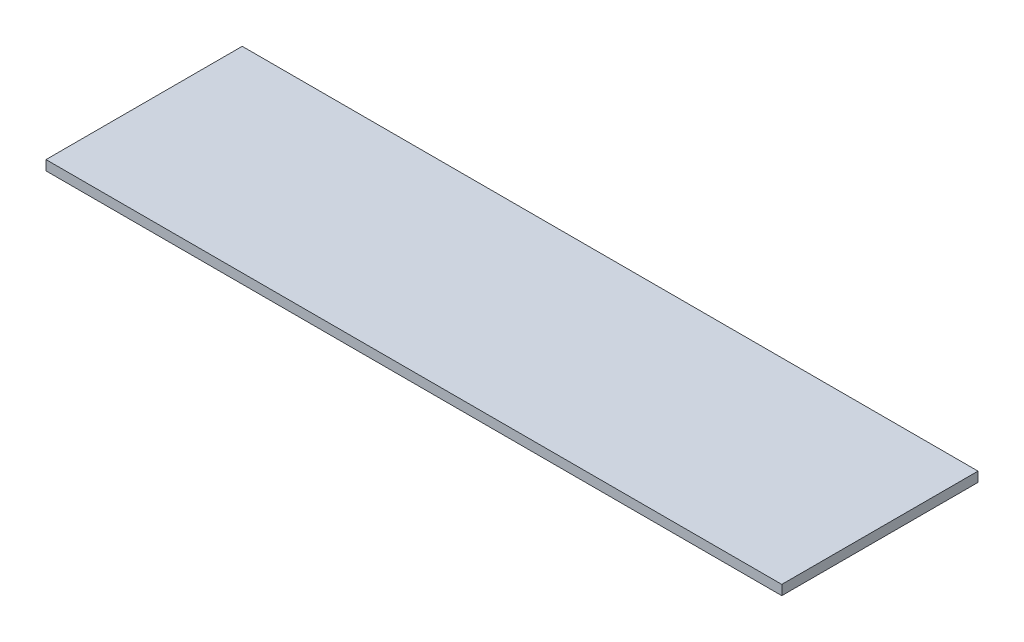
ISO-10303-21;
HEADER;
FILE_DESCRIPTION(('STEP AP214'),'2;1');
FILE_NAME('part.step','',(''),(''),'','','');
FILE_SCHEMA(('AUTOMOTIVE_DESIGN { 1 0 10303 214 1 1 1 1 }'));
ENDSEC;
DATA;
#1=APPLICATION_CONTEXT('core data for automotive mechanical design processes');
#2=APPLICATION_PROTOCOL_DEFINITION('international standard','automotive_design',2000,#1);
#3=PRODUCT_CONTEXT('',#1,'mechanical');
#4=PRODUCT('Part','Part','',(#3));
#5=PRODUCT_RELATED_PRODUCT_CATEGORY('part','',(#4));
#6=PRODUCT_DEFINITION_FORMATION('','',#4);
#7=PRODUCT_DEFINITION_CONTEXT('part definition',#1,'design');
#8=PRODUCT_DEFINITION('design','',#6,#7);
#9=PRODUCT_DEFINITION_SHAPE('','',#8);
#10=(LENGTH_UNIT() NAMED_UNIT(*) SI_UNIT(.MILLI.,.METRE.));
#11=(NAMED_UNIT(*) PLANE_ANGLE_UNIT() SI_UNIT($,.RADIAN.));
#12=(NAMED_UNIT(*) SI_UNIT($,.STERADIAN.) SOLID_ANGLE_UNIT());
#13=UNCERTAINTY_MEASURE_WITH_UNIT(LENGTH_MEASURE(1.E-05),#10,'distance_accuracy_value','');
#14=(GEOMETRIC_REPRESENTATION_CONTEXT(3) GLOBAL_UNCERTAINTY_ASSIGNED_CONTEXT((#13)) GLOBAL_UNIT_ASSIGNED_CONTEXT((#10,
#11,#12)) REPRESENTATION_CONTEXT('',''));
#15=CARTESIAN_POINT('',(0.,0.,0.));
#16=DIRECTION('',(0.,0.,1.));
#17=DIRECTION('',(1.,0.,0.));
#18=AXIS2_PLACEMENT_3D('',#15,#16,#17);
#19=CARTESIAN_POINT('',(0.,1.,0.));
#20=DIRECTION('',(1.,0.,0.));
#21=DIRECTION('',(0.,0.,-1.));
#22=AXIS2_PLACEMENT_3D('',#19,#20,#21);
#23=PLANE('',#22);
#24=DIRECTION('',(0.,0.,1.));
#25=VECTOR('',#24,1.);
#26=CARTESIAN_POINT('',(0.,0.,0.));
#27=LINE('',#26,#25);
#28=CARTESIAN_POINT('',(0.,0.,-20.));
#29=VERTEX_POINT('',#28);
#30=CARTESIAN_POINT('',(0.,0.,0.));
#31=VERTEX_POINT('',#30);
#32=EDGE_CURVE('E74',#29,#31,#27,.T.);
#33=ORIENTED_EDGE('',*,*,#32,.T.);
#34=DIRECTION('',(0.,-1.,0.));
#35=VECTOR('',#34,1.);
#36=CARTESIAN_POINT('',(0.,1.,0.));
#37=LINE('',#36,#35);
#38=CARTESIAN_POINT('',(0.,1.,0.));
#39=VERTEX_POINT('',#38);
#40=EDGE_CURVE('E11',#39,#31,#37,.T.);
#41=ORIENTED_EDGE('',*,*,#40,.F.);
#42=DIRECTION('',(0.,0.,1.));
#43=VECTOR('',#42,1.);
#44=CARTESIAN_POINT('',(0.,1.,0.));
#45=LINE('',#44,#43);
#46=CARTESIAN_POINT('',(0.,1.,-20.));
#47=VERTEX_POINT('',#46);
#48=EDGE_CURVE('E92',#47,#39,#45,.T.);
#49=ORIENTED_EDGE('',*,*,#48,.F.);
#50=DIRECTION('',(0.,-1.,0.));
#51=VECTOR('',#50,1.);
#52=CARTESIAN_POINT('',(0.,1.,-20.));
#53=LINE('',#52,#51);
#54=EDGE_CURVE('E86',#47,#29,#53,.T.);
#55=ORIENTED_EDGE('',*,*,#54,.T.);
#56=EDGE_LOOP('',(#33,#41,#49,#55));
#57=FACE_BOUND('',#56,.T.);
#58=ADVANCED_FACE('F30',(#57),#23,.F.);
#59=CARTESIAN_POINT('',(0.,1.,0.));
#60=DIRECTION('',(0.,0.,-1.));
#61=DIRECTION('',(-1.,0.,0.));
#62=AXIS2_PLACEMENT_3D('',#59,#60,#61);
#63=PLANE('',#62);
#64=DIRECTION('',(1.,0.,0.));
#65=VECTOR('',#64,1.);
#66=CARTESIAN_POINT('',(0.,0.,0.));
#67=LINE('',#66,#65);
#68=CARTESIAN_POINT('',(75.,0.,0.));
#69=VERTEX_POINT('',#68);
#70=EDGE_CURVE('E70',#31,#69,#67,.T.);
#71=ORIENTED_EDGE('',*,*,#70,.T.);
#72=DIRECTION('',(0.,-1.,0.));
#73=VECTOR('',#72,1.);
#74=CARTESIAN_POINT('',(75.,1.,0.));
#75=LINE('',#74,#73);
#76=CARTESIAN_POINT('',(75.,1.,0.));
#77=VERTEX_POINT('',#76);
#78=EDGE_CURVE('E37',#77,#69,#75,.T.);
#79=ORIENTED_EDGE('',*,*,#78,.F.);
#80=DIRECTION('',(1.,0.,0.));
#81=VECTOR('',#80,1.);
#82=CARTESIAN_POINT('',(0.,1.,0.));
#83=LINE('',#82,#81);
#84=EDGE_CURVE('E82',#39,#77,#83,.T.);
#85=ORIENTED_EDGE('',*,*,#84,.F.);
#86=ORIENTED_EDGE('',*,*,#40,.T.);
#87=EDGE_LOOP('',(#71,#79,#85,#86));
#88=FACE_BOUND('',#87,.T.);
#89=ADVANCED_FACE('F81',(#88),#63,.F.);
#90=CARTESIAN_POINT('',(75.,1.,0.));
#91=DIRECTION('',(-1.,0.,0.));
#92=DIRECTION('',(0.,0.,1.));
#93=AXIS2_PLACEMENT_3D('',#90,#91,#92);
#94=PLANE('',#93);
#95=DIRECTION('',(0.,0.,-1.));
#96=VECTOR('',#95,1.);
#97=CARTESIAN_POINT('',(75.,0.,0.));
#98=LINE('',#97,#96);
#99=CARTESIAN_POINT('',(75.,0.,-20.));
#100=VERTEX_POINT('',#99);
#101=EDGE_CURVE('E75',#69,#100,#98,.T.);
#102=ORIENTED_EDGE('',*,*,#101,.T.);
#103=DIRECTION('',(0.,-1.,0.));
#104=VECTOR('',#103,1.);
#105=CARTESIAN_POINT('',(75.,1.,-20.));
#106=LINE('',#105,#104);
#107=CARTESIAN_POINT('',(75.,1.,-20.));
#108=VERTEX_POINT('',#107);
#109=EDGE_CURVE('E98',#108,#100,#106,.T.);
#110=ORIENTED_EDGE('',*,*,#109,.F.);
#111=DIRECTION('',(0.,0.,-1.));
#112=VECTOR('',#111,1.);
#113=CARTESIAN_POINT('',(75.,1.,0.));
#114=LINE('',#113,#112);
#115=EDGE_CURVE('E49',#77,#108,#114,.T.);
#116=ORIENTED_EDGE('',*,*,#115,.F.);
#117=ORIENTED_EDGE('',*,*,#78,.T.);
#118=EDGE_LOOP('',(#102,#110,#116,#117));
#119=FACE_BOUND('',#118,.T.);
#120=ADVANCED_FACE('F101',(#119),#94,.F.);
#121=CARTESIAN_POINT('',(0.,1.,-20.));
#122=DIRECTION('',(0.,0.,1.));
#123=DIRECTION('',(1.,0.,0.));
#124=AXIS2_PLACEMENT_3D('',#121,#122,#123);
#125=PLANE('',#124);
#126=DIRECTION('',(-1.,0.,0.));
#127=VECTOR('',#126,1.);
#128=CARTESIAN_POINT('',(0.,0.,-20.));
#129=LINE('',#128,#127);
#130=EDGE_CURVE('E90',#100,#29,#129,.T.);
#131=ORIENTED_EDGE('',*,*,#130,.T.);
#132=ORIENTED_EDGE('',*,*,#54,.F.);
#133=DIRECTION('',(-1.,0.,0.));
#134=VECTOR('',#133,1.);
#135=CARTESIAN_POINT('',(0.,1.,-20.));
#136=LINE('',#135,#134);
#137=EDGE_CURVE('E44',#108,#47,#136,.T.);
#138=ORIENTED_EDGE('',*,*,#137,.F.);
#139=ORIENTED_EDGE('',*,*,#109,.T.);
#140=EDGE_LOOP('',(#131,#132,#138,#139));
#141=FACE_BOUND('',#140,.T.);
#142=ADVANCED_FACE('F103',(#141),#125,.F.);
#143=CARTESIAN_POINT('',(0.,1.,-20.));
#144=DIRECTION('',(0.,-1.,0.));
#145=DIRECTION('',(0.,0.,-1.));
#146=AXIS2_PLACEMENT_3D('',#143,#144,#145);
#147=PLANE('',#146);
#148=ORIENTED_EDGE('',*,*,#48,.T.);
#149=ORIENTED_EDGE('',*,*,#84,.T.);
#150=ORIENTED_EDGE('',*,*,#115,.T.);
#151=ORIENTED_EDGE('',*,*,#137,.T.);
#152=EDGE_LOOP('',(#148,#149,#150,#151));
#153=FACE_BOUND('',#152,.T.);
#154=ADVANCED_FACE('F104',(#153),#147,.F.);
#155=CARTESIAN_POINT('',(0.,0.,-20.));
#156=DIRECTION('',(0.,-1.,0.));
#157=DIRECTION('',(0.,0.,-1.));
#158=AXIS2_PLACEMENT_3D('',#155,#156,#157);
#159=PLANE('',#158);
#160=ORIENTED_EDGE('',*,*,#32,.F.);
#161=ORIENTED_EDGE('',*,*,#130,.F.);
#162=ORIENTED_EDGE('',*,*,#101,.F.);
#163=ORIENTED_EDGE('',*,*,#70,.F.);
#164=EDGE_LOOP('',(#160,#161,#162,#163));
#165=FACE_BOUND('',#164,.T.);
#166=ADVANCED_FACE('F71',(#165),#159,.T.);
#167=CLOSED_SHELL('',(#58,#89,#120,#142,#154,#166));
#168=MANIFOLD_SOLID_BREP('B2',#167);
#169=ADVANCED_BREP_SHAPE_REPRESENTATION('',(#18,#168),#14);
#170=SHAPE_DEFINITION_REPRESENTATION(#9,#169);
ENDSEC;
END-ISO-10303-21;
